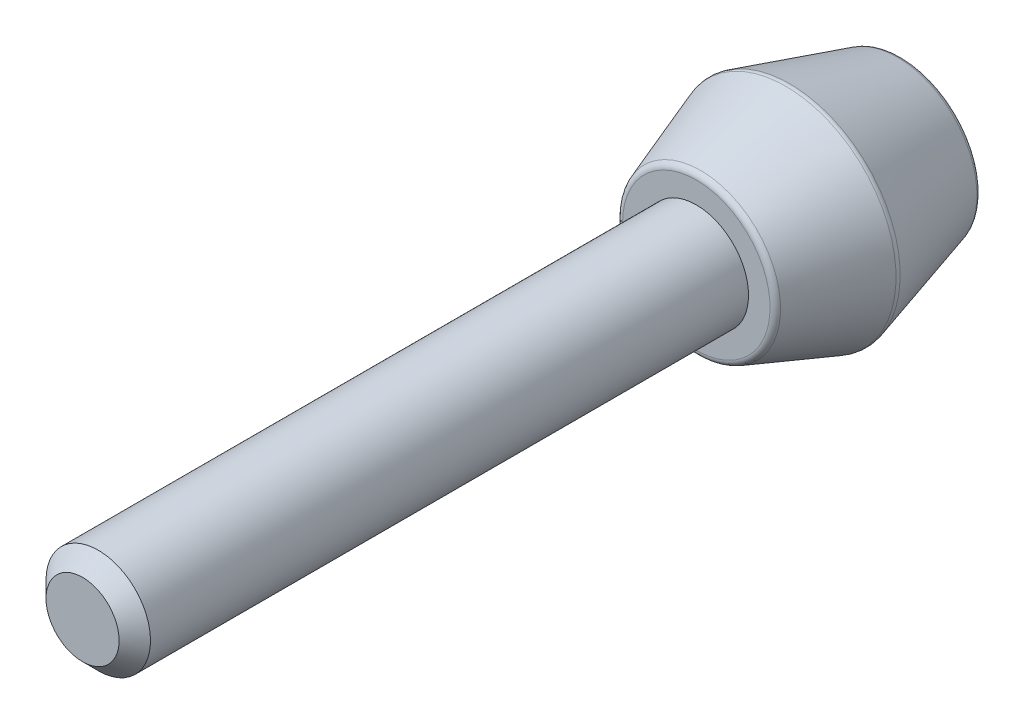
ISO-10303-21;
HEADER;
FILE_DESCRIPTION(('STEP AP214'),'2;1');
FILE_NAME('part.step','',(''),(''),'','','');
FILE_SCHEMA(('AUTOMOTIVE_DESIGN { 1 0 10303 214 1 1 1 1 }'));
ENDSEC;
DATA;
#1=APPLICATION_CONTEXT('core data for automotive mechanical design processes');
#2=APPLICATION_PROTOCOL_DEFINITION('international standard','automotive_design',2000,#1);
#3=PRODUCT_CONTEXT('',#1,'mechanical');
#4=PRODUCT('Part','Part','',(#3));
#5=PRODUCT_RELATED_PRODUCT_CATEGORY('part','',(#4));
#6=PRODUCT_DEFINITION_FORMATION('','',#4);
#7=PRODUCT_DEFINITION_CONTEXT('part definition',#1,'design');
#8=PRODUCT_DEFINITION('design','',#6,#7);
#9=PRODUCT_DEFINITION_SHAPE('','',#8);
#10=(LENGTH_UNIT() NAMED_UNIT(*) SI_UNIT(.MILLI.,.METRE.));
#11=(NAMED_UNIT(*) PLANE_ANGLE_UNIT() SI_UNIT($,.RADIAN.));
#12=(NAMED_UNIT(*) SI_UNIT($,.STERADIAN.) SOLID_ANGLE_UNIT());
#13=UNCERTAINTY_MEASURE_WITH_UNIT(LENGTH_MEASURE(1.E-05),#10,'distance_accuracy_value','');
#14=(GEOMETRIC_REPRESENTATION_CONTEXT(3) GLOBAL_UNCERTAINTY_ASSIGNED_CONTEXT((#13)) GLOBAL_UNIT_ASSIGNED_CONTEXT((#10,
#11,#12)) REPRESENTATION_CONTEXT('',''));
#15=CARTESIAN_POINT('',(0.,0.,0.));
#16=DIRECTION('',(0.,0.,1.));
#17=DIRECTION('',(1.,0.,0.));
#18=AXIS2_PLACEMENT_3D('',#15,#16,#17);
#19=CARTESIAN_POINT('',(0.,0.,15.25));
#20=DIRECTION('',(0.,0.,-1.));
#21=DIRECTION('',(0.379653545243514,0.925128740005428,0.));
#22=AXIS2_PLACEMENT_3D('',#19,#20,#21);
#23=TOROIDAL_SURFACE('',#22,5.64764040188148,0.5);
#24=CARTESIAN_POINT('',(0.,0.,15.4181681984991));
#25=DIRECTION('',(0.,0.,-1.));
#26=DIRECTION('',(0.379653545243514,0.925128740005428,0.));
#27=AXIS2_PLACEMENT_3D('',#24,#25,#26);
#28=CIRCLE('',#27,6.1185113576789);
#29=CARTESIAN_POINT('',(2.32291452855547,5.66041070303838,15.4181681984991));
#30=VERTEX_POINT('',#29);
#31=EDGE_CURVE('E34',#30,#30,#28,.T.);
#32=ORIENTED_EDGE('',*,*,#31,.F.);
#33=EDGE_LOOP('',(#32));
#34=FACE_BOUND('',#33,.T.);
#35=CARTESIAN_POINT('',(0.,0.,15.75));
#36=DIRECTION('',(0.,0.,1.));
#37=DIRECTION('',(0.379653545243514,0.925128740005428,0.));
#38=AXIS2_PLACEMENT_3D('',#35,#36,#37);
#39=CIRCLE('',#38,5.64764040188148);
#40=CARTESIAN_POINT('',(2.14414670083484,5.22479444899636,15.75));
#41=VERTEX_POINT('',#40);
#42=EDGE_CURVE('E29',#41,#41,#39,.T.);
#43=ORIENTED_EDGE('',*,*,#42,.F.);
#44=EDGE_LOOP('',(#43));
#45=FACE_BOUND('',#44,.T.);
#46=ADVANCED_FACE('F12',(#34,#45),#23,.T.);
#47=CARTESIAN_POINT('',(0.,0.,8.73300839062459));
#48=DIRECTION('',(0.,0.,-1.));
#49=DIRECTION('',(0.379653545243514,0.925128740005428,0.));
#50=AXIS2_PLACEMENT_3D('',#47,#48,#49);
#51=TOROIDAL_SURFACE('',#50,7.97513740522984,0.5);
#52=CARTESIAN_POINT('',(0.,0.,8.59564782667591));
#53=DIRECTION('',(0.,0.,-1.));
#54=DIRECTION('',(0.379653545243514,0.925128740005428,0.));
#55=AXIS2_PLACEMENT_3D('',#52,#53,#54);
#56=CIRCLE('',#55,8.45589937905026);
#57=CARTESIAN_POINT('',(3.21031217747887,7.82279553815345,8.59564782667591));
#58=VERTEX_POINT('',#57);
#59=EDGE_CURVE('E39',#58,#58,#56,.T.);
#60=ORIENTED_EDGE('',*,*,#59,.F.);
#61=EDGE_LOOP('',(#60));
#62=FACE_BOUND('',#61,.T.);
#63=CARTESIAN_POINT('',(0.,0.,8.90117658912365));
#64=DIRECTION('',(0.,0.,1.));
#65=DIRECTION('',(-0.379653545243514,-0.925128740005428,0.));
#66=AXIS2_PLACEMENT_3D('',#63,#64,#65);
#67=CIRCLE('',#66,8.44600836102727);
#68=CARTESIAN_POINT('',(-3.20655701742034,-7.81364507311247,8.90117658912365));
#69=VERTEX_POINT('',#68);
#70=EDGE_CURVE('E38',#69,#69,#67,.T.);
#71=ORIENTED_EDGE('',*,*,#70,.F.);
#72=EDGE_LOOP('',(#71));
#73=FACE_BOUND('',#72,.T.);
#74=ADVANCED_FACE('F63',(#62,#73),#51,.T.);
#75=CARTESIAN_POINT('',(0.,0.,0.5));
#76=DIRECTION('',(0.,0.,-1.));
#77=DIRECTION('',(0.379653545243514,0.925128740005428,0.));
#78=AXIS2_PLACEMENT_3D('',#75,#76,#77);
#79=TOROIDAL_SURFACE('',#78,5.62284929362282,0.5);
#80=CARTESIAN_POINT('',(0.,0.,0.));
#81=DIRECTION('',(0.,0.,-1.));
#82=DIRECTION('',(0.379653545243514,0.925128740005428,0.));
#83=AXIS2_PLACEMENT_3D('',#80,#81,#82);
#84=CIRCLE('',#83,5.62284929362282);
#85=CARTESIAN_POINT('',(2.13473466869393,5.20185948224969,0.));
#86=VERTEX_POINT('',#85);
#87=EDGE_CURVE('E33',#86,#86,#84,.T.);
#88=ORIENTED_EDGE('',*,*,#87,.F.);
#89=EDGE_LOOP('',(#88));
#90=FACE_BOUND('',#89,.T.);
#91=CARTESIAN_POINT('',(0.,0.,0.362639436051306));
#92=DIRECTION('',(0.,0.,1.));
#93=DIRECTION('',(0.379653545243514,0.925128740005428,0.));
#94=AXIS2_PLACEMENT_3D('',#91,#92,#93);
#95=CIRCLE('',#94,6.10361126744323);
#96=CARTESIAN_POINT('',(2.31725765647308,5.64662620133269,0.362639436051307));
#97=VERTEX_POINT('',#96);
#98=EDGE_CURVE('E16',#97,#97,#95,.T.);
#99=ORIENTED_EDGE('',*,*,#98,.F.);
#100=EDGE_LOOP('',(#99));
#101=FACE_BOUND('',#100,.T.);
#102=ADVANCED_FACE('F61',(#90,#101),#79,.T.);
#103=CARTESIAN_POINT('',(0.,0.,15.75));
#104=DIRECTION('',(0.,0.,-1.));
#105=DIRECTION('',(0.379653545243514,0.925128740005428,0.));
#106=AXIS2_PLACEMENT_3D('',#103,#104,#105);
#107=CONICAL_SURFACE('',#106,6.,0.343023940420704);
#108=ORIENTED_EDGE('',*,*,#70,.T.);
#109=EDGE_LOOP('',(#108));
#110=FACE_BOUND('',#109,.T.);
#111=ORIENTED_EDGE('',*,*,#31,.T.);
#112=EDGE_LOOP('',(#111));
#113=FACE_BOUND('',#112,.T.);
#114=ADVANCED_FACE('F14',(#110,#113),#107,.T.);
#115=CARTESIAN_POINT('',(0.,0.,0.));
#116=DIRECTION('',(0.,0.,1.));
#117=DIRECTION('',(-0.379653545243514,-0.925128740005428,0.));
#118=AXIS2_PLACEMENT_3D('',#115,#116,#117);
#119=CONICAL_SURFACE('',#118,6.,0.278299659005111);
#120=ORIENTED_EDGE('',*,*,#59,.T.);
#121=EDGE_LOOP('',(#120));
#122=FACE_BOUND('',#121,.T.);
#123=ORIENTED_EDGE('',*,*,#98,.T.);
#124=EDGE_LOOP('',(#123));
#125=FACE_BOUND('',#124,.T.);
#126=ADVANCED_FACE('F59',(#122,#125),#119,.T.);
#127=CARTESIAN_POINT('',(0.,0.,0.));
#128=DIRECTION('',(0.,0.,-1.));
#129=DIRECTION('',(0.379653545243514,0.925128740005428,0.));
#130=AXIS2_PLACEMENT_3D('',#127,#128,#129);
#131=PLANE('',#130);
#132=ORIENTED_EDGE('',*,*,#87,.T.);
#133=EDGE_LOOP('',(#132));
#134=FACE_BOUND('',#133,.T.);
#135=ADVANCED_FACE('F90',(#134),#131,.T.);
#136=CARTESIAN_POINT('',(0.,0.,15.75));
#137=DIRECTION('',(0.,0.,-1.));
#138=DIRECTION('',(0.379653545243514,0.925128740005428,0.));
#139=AXIS2_PLACEMENT_3D('',#136,#137,#138);
#140=PLANE('',#139);
#141=CARTESIAN_POINT('',(0.,0.,15.75));
#142=DIRECTION('',(0.,0.,-1.));
#143=DIRECTION('',(1.,0.,0.));
#144=AXIS2_PLACEMENT_3D('',#141,#142,#143);
#145=CIRCLE('',#144,4.);
#146=CARTESIAN_POINT('',(3.99999999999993,0.,15.75));
#147=VERTEX_POINT('',#146);
#148=EDGE_CURVE('E8',#147,#147,#145,.F.);
#149=ORIENTED_EDGE('',*,*,#148,.F.);
#150=EDGE_LOOP('',(#149));
#151=FACE_BOUND('',#150,.T.);
#152=ORIENTED_EDGE('',*,*,#42,.T.);
#153=EDGE_LOOP('',(#152));
#154=FACE_BOUND('',#153,.T.);
#155=ADVANCED_FACE('F80',(#151,#154),#140,.F.);
#156=CARTESIAN_POINT('',(0.,0.,62.75));
#157=DIRECTION('',(0.,0.,-1.));
#158=DIRECTION('',(0.48127188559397,0.876571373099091,0.));
#159=AXIS2_PLACEMENT_3D('',#156,#157,#158);
#160=PLANE('',#159);
#161=CARTESIAN_POINT('',(0.,0.,62.75));
#162=DIRECTION('',(0.,0.,-1.));
#163=DIRECTION('',(-0.87657137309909,0.48127188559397,0.));
#164=AXIS2_PLACEMENT_3D('',#161,#162,#163);
#165=CIRCLE('',#164,2.8);
#166=CARTESIAN_POINT('',(-2.45439984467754,1.34756127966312,62.75));
#167=VERTEX_POINT('',#166);
#168=EDGE_CURVE('E20',#167,#167,#165,.F.);
#169=ORIENTED_EDGE('',*,*,#168,.T.);
#170=EDGE_LOOP('',(#169));
#171=FACE_BOUND('',#170,.T.);
#172=ADVANCED_FACE('F77',(#171),#160,.F.);
#173=CARTESIAN_POINT('',(0.,0.,61.55));
#174=DIRECTION('',(0.,0.,-1.));
#175=DIRECTION('',(-0.87657137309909,0.48127188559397,0.));
#176=AXIS2_PLACEMENT_3D('',#173,#174,#175);
#177=CONICAL_SURFACE('',#176,4.,0.785398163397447);
#178=ORIENTED_EDGE('',*,*,#168,.F.);
#179=EDGE_LOOP('',(#178));
#180=FACE_BOUND('',#179,.T.);
#181=CARTESIAN_POINT('',(0.,0.,61.55));
#182=DIRECTION('',(0.,0.,-1.));
#183=DIRECTION('',(-0.87657137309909,0.48127188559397,0.));
#184=AXIS2_PLACEMENT_3D('',#181,#182,#183);
#185=CIRCLE('',#184,4.);
#186=CARTESIAN_POINT('',(-3.5062854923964,1.92508754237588,61.55));
#187=VERTEX_POINT('',#186);
#188=EDGE_CURVE('E25',#187,#187,#185,.T.);
#189=ORIENTED_EDGE('',*,*,#188,.F.);
#190=EDGE_LOOP('',(#189));
#191=FACE_BOUND('',#190,.T.);
#192=ADVANCED_FACE('F79',(#180,#191),#177,.T.);
#193=CARTESIAN_POINT('',(0.,0.,2.75));
#194=DIRECTION('',(0.,0.,1.));
#195=DIRECTION('',(-0.481271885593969,-0.876571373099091,0.));
#196=AXIS2_PLACEMENT_3D('',#193,#194,#195);
#197=CYLINDRICAL_SURFACE('',#196,4.);
#198=ORIENTED_EDGE('',*,*,#188,.T.);
#199=EDGE_LOOP('',(#198));
#200=FACE_BOUND('',#199,.T.);
#201=ORIENTED_EDGE('',*,*,#148,.T.);
#202=EDGE_LOOP('',(#201));
#203=FACE_BOUND('',#202,.T.);
#204=ADVANCED_FACE('F88',(#200,#203),#197,.T.);
#205=CLOSED_SHELL('',(#46,#74,#102,#114,#126,#135,#155,#172,#192,#204));
#206=MANIFOLD_SOLID_BREP('B1',#205);
#207=ADVANCED_BREP_SHAPE_REPRESENTATION('',(#18,#206),#14);
#208=SHAPE_DEFINITION_REPRESENTATION(#9,#207);
ENDSEC;
END-ISO-10303-21;
